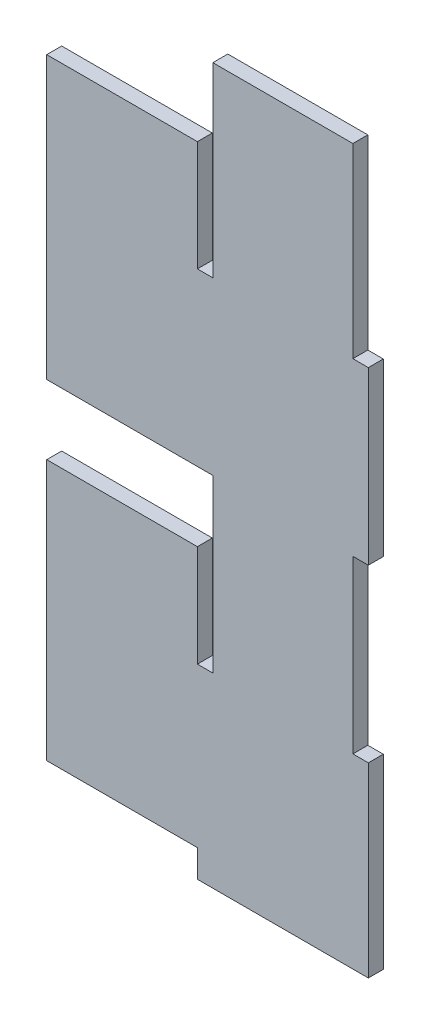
ISO-10303-21;
HEADER;
FILE_DESCRIPTION(('STEP AP214'),'2;1');
FILE_NAME('part.step','',(''),(''),'','','');
FILE_SCHEMA(('AUTOMOTIVE_DESIGN { 1 0 10303 214 1 1 1 1 }'));
ENDSEC;
DATA;
#1=APPLICATION_CONTEXT('core data for automotive mechanical design processes');
#2=APPLICATION_PROTOCOL_DEFINITION('international standard','automotive_design',2000,#1);
#3=PRODUCT_CONTEXT('',#1,'mechanical');
#4=PRODUCT('Part','Part','',(#3));
#5=PRODUCT_RELATED_PRODUCT_CATEGORY('part','',(#4));
#6=PRODUCT_DEFINITION_FORMATION('','',#4);
#7=PRODUCT_DEFINITION_CONTEXT('part definition',#1,'design');
#8=PRODUCT_DEFINITION('design','',#6,#7);
#9=PRODUCT_DEFINITION_SHAPE('','',#8);
#10=(LENGTH_UNIT() NAMED_UNIT(*) SI_UNIT(.MILLI.,.METRE.));
#11=(NAMED_UNIT(*) PLANE_ANGLE_UNIT() SI_UNIT($,.RADIAN.));
#12=(NAMED_UNIT(*) SI_UNIT($,.STERADIAN.) SOLID_ANGLE_UNIT());
#13=UNCERTAINTY_MEASURE_WITH_UNIT(LENGTH_MEASURE(1.E-05),#10,'distance_accuracy_value','');
#14=(GEOMETRIC_REPRESENTATION_CONTEXT(3) GLOBAL_UNCERTAINTY_ASSIGNED_CONTEXT((#13)) GLOBAL_UNIT_ASSIGNED_CONTEXT((#10,
#11,#12)) REPRESENTATION_CONTEXT('',''));
#15=CARTESIAN_POINT('',(0.,0.,0.));
#16=DIRECTION('',(0.,0.,1.));
#17=DIRECTION('',(1.,0.,0.));
#18=AXIS2_PLACEMENT_3D('',#15,#16,#17);
#19=CARTESIAN_POINT('',(0.,206.72,3.));
#20=DIRECTION('',(1.,0.,0.));
#21=DIRECTION('',(0.,1.,0.));
#22=AXIS2_PLACEMENT_3D('',#19,#20,#21);
#23=PLANE('',#22);
#24=DIRECTION('',(0.,-1.,0.));
#25=VECTOR('',#24,1.);
#26=CARTESIAN_POINT('',(0.,206.72,-3.));
#27=LINE('',#26,#25);
#28=CARTESIAN_POINT('',(0.,281.5,-3.));
#29=VERTEX_POINT('',#28);
#30=CARTESIAN_POINT('',(0.,206.72,-3.));
#31=VERTEX_POINT('',#30);
#32=EDGE_CURVE('E230',#29,#31,#27,.T.);
#33=ORIENTED_EDGE('',*,*,#32,.T.);
#34=DIRECTION('',(0.,0.,-1.));
#35=VECTOR('',#34,1.);
#36=CARTESIAN_POINT('',(0.,206.72,3.));
#37=LINE('',#36,#35);
#38=CARTESIAN_POINT('',(0.,206.72,3.));
#39=VERTEX_POINT('',#38);
#40=EDGE_CURVE('E11',#39,#31,#37,.T.);
#41=ORIENTED_EDGE('',*,*,#40,.F.);
#42=DIRECTION('',(0.,-1.,0.));
#43=VECTOR('',#42,1.);
#44=CARTESIAN_POINT('',(0.,206.72,3.));
#45=LINE('',#44,#43);
#46=CARTESIAN_POINT('',(0.,281.5,3.));
#47=VERTEX_POINT('',#46);
#48=EDGE_CURVE('E295',#47,#39,#45,.T.);
#49=ORIENTED_EDGE('',*,*,#48,.F.);
#50=DIRECTION('',(0.,0.,-1.));
#51=VECTOR('',#50,1.);
#52=CARTESIAN_POINT('',(0.,281.5,3.));
#53=LINE('',#52,#51);
#54=EDGE_CURVE('E226',#47,#29,#53,.T.);
#55=ORIENTED_EDGE('',*,*,#54,.T.);
#56=EDGE_LOOP('',(#33,#41,#49,#55));
#57=FACE_BOUND('',#56,.T.);
#58=ADVANCED_FACE('F45',(#57),#23,.F.);
#59=CARTESIAN_POINT('',(0.,206.72,3.));
#60=DIRECTION('',(0.,-1.,0.));
#61=DIRECTION('',(0.,0.,-1.));
#62=AXIS2_PLACEMENT_3D('',#59,#60,#61);
#63=PLANE('',#62);
#64=DIRECTION('',(-1.,0.,0.));
#65=VECTOR('',#64,1.);
#66=CARTESIAN_POINT('',(0.,206.72,-3.));
#67=LINE('',#66,#65);
#68=CARTESIAN_POINT('',(-6.20000000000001,206.72,-3.));
#69=VERTEX_POINT('',#68);
#70=EDGE_CURVE('E234',#31,#69,#67,.T.);
#71=ORIENTED_EDGE('',*,*,#70,.T.);
#72=DIRECTION('',(0.,0.,-1.));
#73=VECTOR('',#72,1.);
#74=CARTESIAN_POINT('',(-6.20000000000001,206.72,3.));
#75=LINE('',#74,#73);
#76=CARTESIAN_POINT('',(-6.20000000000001,206.72,3.));
#77=VERTEX_POINT('',#76);
#78=EDGE_CURVE('E54',#77,#69,#75,.T.);
#79=ORIENTED_EDGE('',*,*,#78,.F.);
#80=DIRECTION('',(-1.,0.,0.));
#81=VECTOR('',#80,1.);
#82=CARTESIAN_POINT('',(0.,206.72,3.));
#83=LINE('',#82,#81);
#84=EDGE_CURVE('E147',#39,#77,#83,.T.);
#85=ORIENTED_EDGE('',*,*,#84,.F.);
#86=ORIENTED_EDGE('',*,*,#40,.T.);
#87=EDGE_LOOP('',(#71,#79,#85,#86));
#88=FACE_BOUND('',#87,.T.);
#89=ADVANCED_FACE('F458',(#88),#63,.F.);
#90=CARTESIAN_POINT('',(-6.20000000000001,250.951201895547,3.));
#91=DIRECTION('',(-1.,0.,0.));
#92=DIRECTION('',(0.,0.,1.));
#93=AXIS2_PLACEMENT_3D('',#90,#91,#92);
#94=PLANE('',#93);
#95=DIRECTION('',(0.,1.,0.));
#96=VECTOR('',#95,1.);
#97=CARTESIAN_POINT('',(-6.20000000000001,250.951201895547,-3.));
#98=LINE('',#97,#96);
#99=CARTESIAN_POINT('',(-6.20000000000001,250.951201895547,-3.));
#100=VERTEX_POINT('',#99);
#101=EDGE_CURVE('E237',#69,#100,#98,.T.);
#102=ORIENTED_EDGE('',*,*,#101,.T.);
#103=DIRECTION('',(0.,0.,-1.));
#104=VECTOR('',#103,1.);
#105=CARTESIAN_POINT('',(-6.20000000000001,250.951201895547,3.));
#106=LINE('',#105,#104);
#107=CARTESIAN_POINT('',(-6.20000000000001,250.951201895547,3.));
#108=VERTEX_POINT('',#107);
#109=EDGE_CURVE('E362',#108,#100,#106,.T.);
#110=ORIENTED_EDGE('',*,*,#109,.F.);
#111=DIRECTION('',(0.,1.,0.));
#112=VECTOR('',#111,1.);
#113=CARTESIAN_POINT('',(-6.20000000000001,250.951201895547,3.));
#114=LINE('',#113,#112);
#115=EDGE_CURVE('E372',#77,#108,#114,.T.);
#116=ORIENTED_EDGE('',*,*,#115,.F.);
#117=ORIENTED_EDGE('',*,*,#78,.T.);
#118=EDGE_LOOP('',(#102,#110,#116,#117));
#119=FACE_BOUND('',#118,.T.);
#120=ADVANCED_FACE('F370',(#119),#94,.F.);
#121=CARTESIAN_POINT('',(-6.20000000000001,250.951201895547,3.));
#122=DIRECTION('',(0.,-1.,0.));
#123=DIRECTION('',(0.,0.,-1.));
#124=AXIS2_PLACEMENT_3D('',#121,#122,#123);
#125=PLANE('',#124);
#126=DIRECTION('',(-1.,0.,0.));
#127=VECTOR('',#126,1.);
#128=CARTESIAN_POINT('',(-6.20000000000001,250.951201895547,-3.));
#129=LINE('',#128,#127);
#130=CARTESIAN_POINT('',(-66.6678232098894,250.951201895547,-3.));
#131=VERTEX_POINT('',#130);
#132=EDGE_CURVE('E240',#100,#131,#129,.T.);
#133=ORIENTED_EDGE('',*,*,#132,.T.);
#134=DIRECTION('',(0.,0.,-1.));
#135=VECTOR('',#134,1.);
#136=CARTESIAN_POINT('',(-66.6678232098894,250.951201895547,3.));
#137=LINE('',#136,#135);
#138=CARTESIAN_POINT('',(-66.6678232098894,250.951201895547,3.));
#139=VERTEX_POINT('',#138);
#140=EDGE_CURVE('E358',#139,#131,#137,.T.);
#141=ORIENTED_EDGE('',*,*,#140,.F.);
#142=DIRECTION('',(-1.,0.,0.));
#143=VECTOR('',#142,1.);
#144=CARTESIAN_POINT('',(-6.20000000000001,250.951201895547,3.));
#145=LINE('',#144,#143);
#146=EDGE_CURVE('E390',#108,#139,#145,.T.);
#147=ORIENTED_EDGE('',*,*,#146,.F.);
#148=ORIENTED_EDGE('',*,*,#109,.T.);
#149=EDGE_LOOP('',(#133,#141,#147,#148));
#150=FACE_BOUND('',#149,.T.);
#151=ADVANCED_FACE('F380',(#150),#125,.F.);
#152=CARTESIAN_POINT('',(-66.6678232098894,250.951201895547,3.));
#153=DIRECTION('',(1.,0.,0.));
#154=DIRECTION('',(0.,0.,-1.));
#155=AXIS2_PLACEMENT_3D('',#152,#153,#154);
#156=PLANE('',#155);
#157=DIRECTION('',(0.,-1.,0.));
#158=VECTOR('',#157,1.);
#159=CARTESIAN_POINT('',(-66.6678232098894,250.951201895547,-3.));
#160=LINE('',#159,#158);
#161=CARTESIAN_POINT('',(-66.6678232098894,138.04,-3.));
#162=VERTEX_POINT('',#161);
#163=EDGE_CURVE('E243',#131,#162,#160,.T.);
#164=ORIENTED_EDGE('',*,*,#163,.T.);
#165=DIRECTION('',(0.,0.,-1.));
#166=VECTOR('',#165,1.);
#167=CARTESIAN_POINT('',(-66.6678232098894,138.04,3.));
#168=LINE('',#167,#166);
#169=CARTESIAN_POINT('',(-66.6678232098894,138.04,3.));
#170=VERTEX_POINT('',#169);
#171=EDGE_CURVE('E354',#170,#162,#168,.T.);
#172=ORIENTED_EDGE('',*,*,#171,.F.);
#173=DIRECTION('',(0.,-1.,0.));
#174=VECTOR('',#173,1.);
#175=CARTESIAN_POINT('',(-66.6678232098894,250.951201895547,3.));
#176=LINE('',#175,#174);
#177=EDGE_CURVE('E386',#139,#170,#176,.T.);
#178=ORIENTED_EDGE('',*,*,#177,.F.);
#179=ORIENTED_EDGE('',*,*,#140,.T.);
#180=EDGE_LOOP('',(#164,#172,#178,#179));
#181=FACE_BOUND('',#180,.T.);
#182=ADVANCED_FACE('F384',(#181),#156,.F.);
#183=CARTESIAN_POINT('',(0.,138.04,3.));
#184=DIRECTION('',(0.,1.,0.));
#185=DIRECTION('',(0.,0.,1.));
#186=AXIS2_PLACEMENT_3D('',#183,#184,#185);
#187=PLANE('',#186);
#188=DIRECTION('',(1.,0.,0.));
#189=VECTOR('',#188,1.);
#190=CARTESIAN_POINT('',(0.,138.04,-3.));
#191=LINE('',#190,#189);
#192=CARTESIAN_POINT('',(0.,138.04,-3.));
#193=VERTEX_POINT('',#192);
#194=EDGE_CURVE('E247',#162,#193,#191,.T.);
#195=ORIENTED_EDGE('',*,*,#194,.T.);
#196=DIRECTION('',(0.,0.,-1.));
#197=VECTOR('',#196,1.);
#198=CARTESIAN_POINT('',(0.,138.04,3.));
#199=LINE('',#198,#197);
#200=CARTESIAN_POINT('',(0.,138.04,3.));
#201=VERTEX_POINT('',#200);
#202=EDGE_CURVE('E350',#201,#193,#199,.T.);
#203=ORIENTED_EDGE('',*,*,#202,.F.);
#204=DIRECTION('',(1.,0.,0.));
#205=VECTOR('',#204,1.);
#206=CARTESIAN_POINT('',(-6.19999999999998,138.04,3.));
#207=LINE('',#206,#205);
#208=EDGE_CURVE('E389',#170,#201,#207,.T.);
#209=ORIENTED_EDGE('',*,*,#208,.F.);
#210=ORIENTED_EDGE('',*,*,#171,.T.);
#211=EDGE_LOOP('',(#195,#203,#209,#210));
#212=FACE_BOUND('',#211,.T.);
#213=ADVANCED_FACE('F471',(#212),#187,.F.);
#214=CARTESIAN_POINT('',(0.,69.3600000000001,3.));
#215=DIRECTION('',(1.,0.,0.));
#216=DIRECTION('',(0.,1.,0.));
#217=AXIS2_PLACEMENT_3D('',#214,#215,#216);
#218=PLANE('',#217);
#219=DIRECTION('',(0.,-1.,0.));
#220=VECTOR('',#219,1.);
#221=CARTESIAN_POINT('',(0.,69.3600000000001,-3.));
#222=LINE('',#221,#220);
#223=CARTESIAN_POINT('',(0.,69.3600000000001,-3.));
#224=VERTEX_POINT('',#223);
#225=EDGE_CURVE('E250',#193,#224,#222,.T.);
#226=ORIENTED_EDGE('',*,*,#225,.T.);
#227=DIRECTION('',(0.,0.,-1.));
#228=VECTOR('',#227,1.);
#229=CARTESIAN_POINT('',(0.,69.3600000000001,3.));
#230=LINE('',#229,#228);
#231=CARTESIAN_POINT('',(0.,69.3600000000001,3.));
#232=VERTEX_POINT('',#231);
#233=EDGE_CURVE('E346',#232,#224,#230,.T.);
#234=ORIENTED_EDGE('',*,*,#233,.F.);
#235=DIRECTION('',(0.,-1.,0.));
#236=VECTOR('',#235,1.);
#237=CARTESIAN_POINT('',(0.,69.3600000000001,3.));
#238=LINE('',#237,#236);
#239=EDGE_CURVE('E394',#201,#232,#238,.T.);
#240=ORIENTED_EDGE('',*,*,#239,.F.);
#241=ORIENTED_EDGE('',*,*,#202,.T.);
#242=EDGE_LOOP('',(#226,#234,#240,#241));
#243=FACE_BOUND('',#242,.T.);
#244=ADVANCED_FACE('F474',(#243),#218,.F.);
#245=CARTESIAN_POINT('',(0.,69.3600000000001,3.));
#246=DIRECTION('',(0.,-1.,0.));
#247=DIRECTION('',(0.,0.,-1.));
#248=AXIS2_PLACEMENT_3D('',#245,#246,#247);
#249=PLANE('',#248);
#250=DIRECTION('',(-1.,0.,0.));
#251=VECTOR('',#250,1.);
#252=CARTESIAN_POINT('',(0.,69.3600000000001,-3.));
#253=LINE('',#252,#251);
#254=CARTESIAN_POINT('',(-6.19999999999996,69.3600000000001,-3.));
#255=VERTEX_POINT('',#254);
#256=EDGE_CURVE('E253',#224,#255,#253,.T.);
#257=ORIENTED_EDGE('',*,*,#256,.T.);
#258=DIRECTION('',(0.,0.,-1.));
#259=VECTOR('',#258,1.);
#260=CARTESIAN_POINT('',(-6.19999999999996,69.3600000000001,3.));
#261=LINE('',#260,#259);
#262=CARTESIAN_POINT('',(-6.19999999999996,69.3600000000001,3.));
#263=VERTEX_POINT('',#262);
#264=EDGE_CURVE('E342',#263,#255,#261,.T.);
#265=ORIENTED_EDGE('',*,*,#264,.F.);
#266=DIRECTION('',(-1.,0.,0.));
#267=VECTOR('',#266,1.);
#268=CARTESIAN_POINT('',(0.,69.3600000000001,3.));
#269=LINE('',#268,#267);
#270=EDGE_CURVE('E401',#232,#263,#269,.T.);
#271=ORIENTED_EDGE('',*,*,#270,.F.);
#272=ORIENTED_EDGE('',*,*,#233,.T.);
#273=EDGE_LOOP('',(#257,#265,#271,#272));
#274=FACE_BOUND('',#273,.T.);
#275=ADVANCED_FACE('F478',(#274),#249,.F.);
#276=CARTESIAN_POINT('',(-6.19999999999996,69.3600000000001,3.));
#277=DIRECTION('',(-1.,0.,0.));
#278=DIRECTION('',(0.,-1.,0.));
#279=AXIS2_PLACEMENT_3D('',#276,#277,#278);
#280=PLANE('',#279);
#281=DIRECTION('',(0.,1.,0.));
#282=VECTOR('',#281,1.);
#283=CARTESIAN_POINT('',(-6.19999999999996,69.3600000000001,-3.));
#284=LINE('',#283,#282);
#285=CARTESIAN_POINT('',(-6.19999999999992,110.191945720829,-3.));
#286=VERTEX_POINT('',#285);
#287=EDGE_CURVE('E256',#255,#286,#284,.T.);
#288=ORIENTED_EDGE('',*,*,#287,.T.);
#289=DIRECTION('',(0.,0.,-1.));
#290=VECTOR('',#289,1.);
#291=CARTESIAN_POINT('',(-6.19999999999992,110.191945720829,3.));
#292=LINE('',#291,#290);
#293=CARTESIAN_POINT('',(-6.19999999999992,110.191945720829,3.));
#294=VERTEX_POINT('',#293);
#295=EDGE_CURVE('E338',#294,#286,#292,.T.);
#296=ORIENTED_EDGE('',*,*,#295,.F.);
#297=DIRECTION('',(0.,1.,0.));
#298=VECTOR('',#297,1.);
#299=CARTESIAN_POINT('',(-6.19999999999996,69.3600000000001,3.));
#300=LINE('',#299,#298);
#301=EDGE_CURVE('E404',#263,#294,#300,.T.);
#302=ORIENTED_EDGE('',*,*,#301,.F.);
#303=ORIENTED_EDGE('',*,*,#264,.T.);
#304=EDGE_LOOP('',(#288,#296,#302,#303));
#305=FACE_BOUND('',#304,.T.);
#306=ADVANCED_FACE('F482',(#305),#280,.F.);
#307=CARTESIAN_POINT('',(-6.19999999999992,110.191945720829,3.));
#308=DIRECTION('',(0.,-1.,0.));
#309=DIRECTION('',(0.,0.,-1.));
#310=AXIS2_PLACEMENT_3D('',#307,#308,#309);
#311=PLANE('',#310);
#312=DIRECTION('',(-1.,0.,0.));
#313=VECTOR('',#312,1.);
#314=CARTESIAN_POINT('',(-6.19999999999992,110.191945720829,-3.));
#315=LINE('',#314,#313);
#316=CARTESIAN_POINT('',(-66.6678232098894,110.191945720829,-3.));
#317=VERTEX_POINT('',#316);
#318=EDGE_CURVE('E259',#286,#317,#315,.T.);
#319=ORIENTED_EDGE('',*,*,#318,.T.);
#320=DIRECTION('',(0.,0.,-1.));
#321=VECTOR('',#320,1.);
#322=CARTESIAN_POINT('',(-66.6678232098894,110.191945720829,3.));
#323=LINE('',#322,#321);
#324=CARTESIAN_POINT('',(-66.6678232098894,110.191945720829,3.));
#325=VERTEX_POINT('',#324);
#326=EDGE_CURVE('E334',#325,#317,#323,.T.);
#327=ORIENTED_EDGE('',*,*,#326,.F.);
#328=DIRECTION('',(-1.,0.,0.));
#329=VECTOR('',#328,1.);
#330=CARTESIAN_POINT('',(-6.19999999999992,110.191945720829,3.));
#331=LINE('',#330,#329);
#332=EDGE_CURVE('E407',#294,#325,#331,.T.);
#333=ORIENTED_EDGE('',*,*,#332,.F.);
#334=ORIENTED_EDGE('',*,*,#295,.T.);
#335=EDGE_LOOP('',(#319,#327,#333,#334));
#336=FACE_BOUND('',#335,.T.);
#337=ADVANCED_FACE('F486',(#336),#311,.F.);
#338=CARTESIAN_POINT('',(-66.6678232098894,5.58000000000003,3.));
#339=DIRECTION('',(1.,0.,0.));
#340=DIRECTION('',(0.,0.,-1.));
#341=AXIS2_PLACEMENT_3D('',#338,#339,#340);
#342=PLANE('',#341);
#343=DIRECTION('',(0.,-1.,0.));
#344=VECTOR('',#343,1.);
#345=CARTESIAN_POINT('',(-66.6678232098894,5.58000000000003,-3.));
#346=LINE('',#345,#344);
#347=CARTESIAN_POINT('',(-66.6678232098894,5.58000000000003,-3.));
#348=VERTEX_POINT('',#347);
#349=EDGE_CURVE('E262',#317,#348,#346,.T.);
#350=ORIENTED_EDGE('',*,*,#349,.T.);
#351=DIRECTION('',(0.,0.,-1.));
#352=VECTOR('',#351,1.);
#353=CARTESIAN_POINT('',(-66.6678232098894,5.58000000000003,3.));
#354=LINE('',#353,#352);
#355=CARTESIAN_POINT('',(-66.6678232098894,5.58000000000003,3.));
#356=VERTEX_POINT('',#355);
#357=EDGE_CURVE('E330',#356,#348,#354,.T.);
#358=ORIENTED_EDGE('',*,*,#357,.F.);
#359=DIRECTION('',(0.,-1.,0.));
#360=VECTOR('',#359,1.);
#361=CARTESIAN_POINT('',(-66.6678232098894,5.58000000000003,3.));
#362=LINE('',#361,#360);
#363=EDGE_CURVE('E410',#325,#356,#362,.T.);
#364=ORIENTED_EDGE('',*,*,#363,.F.);
#365=ORIENTED_EDGE('',*,*,#326,.T.);
#366=EDGE_LOOP('',(#350,#358,#364,#365));
#367=FACE_BOUND('',#366,.T.);
#368=ADVANCED_FACE('F490',(#367),#342,.F.);
#369=CARTESIAN_POINT('',(-6.19999999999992,5.58000000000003,3.));
#370=DIRECTION('',(0.,1.,0.));
#371=DIRECTION('',(0.,0.,1.));
#372=AXIS2_PLACEMENT_3D('',#369,#370,#371);
#373=PLANE('',#372);
#374=DIRECTION('',(1.,0.,0.));
#375=VECTOR('',#374,1.);
#376=CARTESIAN_POINT('',(-6.19999999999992,5.58000000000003,-3.));
#377=LINE('',#376,#375);
#378=CARTESIAN_POINT('',(-6.19999999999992,5.58000000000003,-3.));
#379=VERTEX_POINT('',#378);
#380=EDGE_CURVE('E265',#348,#379,#377,.T.);
#381=ORIENTED_EDGE('',*,*,#380,.T.);
#382=DIRECTION('',(0.,0.,-1.));
#383=VECTOR('',#382,1.);
#384=CARTESIAN_POINT('',(-6.19999999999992,5.58000000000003,3.));
#385=LINE('',#384,#383);
#386=CARTESIAN_POINT('',(-6.19999999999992,5.58000000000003,3.));
#387=VERTEX_POINT('',#386);
#388=EDGE_CURVE('E326',#387,#379,#385,.T.);
#389=ORIENTED_EDGE('',*,*,#388,.F.);
#390=DIRECTION('',(1.,0.,0.));
#391=VECTOR('',#390,1.);
#392=CARTESIAN_POINT('',(-6.19999999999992,5.58000000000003,3.));
#393=LINE('',#392,#391);
#394=EDGE_CURVE('E413',#356,#387,#393,.T.);
#395=ORIENTED_EDGE('',*,*,#394,.F.);
#396=ORIENTED_EDGE('',*,*,#357,.T.);
#397=EDGE_LOOP('',(#381,#389,#395,#396));
#398=FACE_BOUND('',#397,.T.);
#399=ADVANCED_FACE('F494',(#398),#373,.F.);
#400=CARTESIAN_POINT('',(-6.19999999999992,5.58000000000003,3.));
#401=DIRECTION('',(1.,0.,0.));
#402=DIRECTION('',(0.,1.,0.));
#403=AXIS2_PLACEMENT_3D('',#400,#401,#402);
#404=PLANE('',#403);
#405=DIRECTION('',(0.,-1.,0.));
#406=VECTOR('',#405,1.);
#407=CARTESIAN_POINT('',(-6.19999999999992,5.58000000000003,-3.));
#408=LINE('',#407,#406);
#409=CARTESIAN_POINT('',(-6.19999999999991,-5.41999999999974,-3.));
#410=VERTEX_POINT('',#409);
#411=EDGE_CURVE('E268',#379,#410,#408,.T.);
#412=ORIENTED_EDGE('',*,*,#411,.T.);
#413=DIRECTION('',(0.,0.,-1.));
#414=VECTOR('',#413,1.);
#415=CARTESIAN_POINT('',(-6.19999999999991,-5.41999999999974,3.));
#416=LINE('',#415,#414);
#417=CARTESIAN_POINT('',(-6.19999999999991,-5.41999999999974,3.));
#418=VERTEX_POINT('',#417);
#419=EDGE_CURVE('E322',#418,#410,#416,.T.);
#420=ORIENTED_EDGE('',*,*,#419,.F.);
#421=DIRECTION('',(0.,-1.,0.));
#422=VECTOR('',#421,1.);
#423=CARTESIAN_POINT('',(-6.19999999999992,5.58000000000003,3.));
#424=LINE('',#423,#422);
#425=EDGE_CURVE('E416',#387,#418,#424,.T.);
#426=ORIENTED_EDGE('',*,*,#425,.F.);
#427=ORIENTED_EDGE('',*,*,#388,.T.);
#428=EDGE_LOOP('',(#412,#420,#426,#427));
#429=FACE_BOUND('',#428,.T.);
#430=ADVANCED_FACE('F498',(#429),#404,.F.);
#431=CARTESIAN_POINT('',(-6.19999999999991,-5.41999999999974,3.));
#432=DIRECTION('',(0.,1.,0.));
#433=DIRECTION('',(-1.,0.,0.));
#434=AXIS2_PLACEMENT_3D('',#431,#432,#433);
#435=PLANE('',#434);
#436=DIRECTION('',(1.,0.,0.));
#437=VECTOR('',#436,1.);
#438=CARTESIAN_POINT('',(-6.19999999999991,-5.41999999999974,-3.));
#439=LINE('',#438,#437);
#440=CARTESIAN_POINT('',(62.4,-5.41999999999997,-3.));
#441=VERTEX_POINT('',#440);
#442=EDGE_CURVE('E271',#410,#441,#439,.T.);
#443=ORIENTED_EDGE('',*,*,#442,.T.);
#444=DIRECTION('',(0.,0.,-1.));
#445=VECTOR('',#444,1.);
#446=CARTESIAN_POINT('',(62.4,-5.41999999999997,3.));
#447=LINE('',#446,#445);
#448=CARTESIAN_POINT('',(62.4,-5.41999999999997,3.));
#449=VERTEX_POINT('',#448);
#450=EDGE_CURVE('E318',#449,#441,#447,.T.);
#451=ORIENTED_EDGE('',*,*,#450,.F.);
#452=DIRECTION('',(1.,0.,0.));
#453=VECTOR('',#452,1.);
#454=CARTESIAN_POINT('',(-6.19999999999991,-5.41999999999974,3.));
#455=LINE('',#454,#453);
#456=EDGE_CURVE('E419',#418,#449,#455,.T.);
#457=ORIENTED_EDGE('',*,*,#456,.F.);
#458=ORIENTED_EDGE('',*,*,#419,.T.);
#459=EDGE_LOOP('',(#443,#451,#457,#458));
#460=FACE_BOUND('',#459,.T.);
#461=ADVANCED_FACE('F502',(#460),#435,.F.);
#462=CARTESIAN_POINT('',(62.4,-5.41999999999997,3.));
#463=DIRECTION('',(-1.,0.,0.));
#464=DIRECTION('',(0.,-1.,0.));
#465=AXIS2_PLACEMENT_3D('',#462,#463,#464);
#466=PLANE('',#465);
#467=DIRECTION('',(0.,1.,0.));
#468=VECTOR('',#467,1.);
#469=CARTESIAN_POINT('',(62.4,-5.41999999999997,-3.));
#470=LINE('',#469,#468);
#471=CARTESIAN_POINT('',(62.4,69.36,-3.));
#472=VERTEX_POINT('',#471);
#473=EDGE_CURVE('E274',#441,#472,#470,.T.);
#474=ORIENTED_EDGE('',*,*,#473,.T.);
#475=DIRECTION('',(0.,0.,-1.));
#476=VECTOR('',#475,1.);
#477=CARTESIAN_POINT('',(62.4,69.36,3.));
#478=LINE('',#477,#476);
#479=CARTESIAN_POINT('',(62.4,69.36,3.));
#480=VERTEX_POINT('',#479);
#481=EDGE_CURVE('E314',#480,#472,#478,.T.);
#482=ORIENTED_EDGE('',*,*,#481,.F.);
#483=DIRECTION('',(0.,1.,0.));
#484=VECTOR('',#483,1.);
#485=CARTESIAN_POINT('',(62.4,-5.41999999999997,3.));
#486=LINE('',#485,#484);
#487=EDGE_CURVE('E422',#449,#480,#486,.T.);
#488=ORIENTED_EDGE('',*,*,#487,.F.);
#489=ORIENTED_EDGE('',*,*,#450,.T.);
#490=EDGE_LOOP('',(#474,#482,#488,#489));
#491=FACE_BOUND('',#490,.T.);
#492=ADVANCED_FACE('F506',(#491),#466,.F.);
#493=CARTESIAN_POINT('',(56.2,69.36,3.));
#494=DIRECTION('',(0.,-1.,0.));
#495=DIRECTION('',(0.,0.,-1.));
#496=AXIS2_PLACEMENT_3D('',#493,#494,#495);
#497=PLANE('',#496);
#498=DIRECTION('',(-1.,0.,0.));
#499=VECTOR('',#498,1.);
#500=CARTESIAN_POINT('',(56.2,69.36,-3.));
#501=LINE('',#500,#499);
#502=CARTESIAN_POINT('',(56.2,69.36,-3.));
#503=VERTEX_POINT('',#502);
#504=EDGE_CURVE('E277',#472,#503,#501,.T.);
#505=ORIENTED_EDGE('',*,*,#504,.T.);
#506=DIRECTION('',(0.,0.,-1.));
#507=VECTOR('',#506,1.);
#508=CARTESIAN_POINT('',(56.2,69.36,3.));
#509=LINE('',#508,#507);
#510=CARTESIAN_POINT('',(56.2,69.36,3.));
#511=VERTEX_POINT('',#510);
#512=EDGE_CURVE('E310',#511,#503,#509,.T.);
#513=ORIENTED_EDGE('',*,*,#512,.F.);
#514=DIRECTION('',(-1.,0.,0.));
#515=VECTOR('',#514,1.);
#516=CARTESIAN_POINT('',(56.2,69.36,3.));
#517=LINE('',#516,#515);
#518=EDGE_CURVE('E425',#480,#511,#517,.T.);
#519=ORIENTED_EDGE('',*,*,#518,.F.);
#520=ORIENTED_EDGE('',*,*,#481,.T.);
#521=EDGE_LOOP('',(#505,#513,#519,#520));
#522=FACE_BOUND('',#521,.T.);
#523=ADVANCED_FACE('F510',(#522),#497,.F.);
#524=CARTESIAN_POINT('',(56.2,138.04,3.));
#525=DIRECTION('',(-1.,0.,0.));
#526=DIRECTION('',(0.,-1.,0.));
#527=AXIS2_PLACEMENT_3D('',#524,#525,#526);
#528=PLANE('',#527);
#529=DIRECTION('',(0.,1.,0.));
#530=VECTOR('',#529,1.);
#531=CARTESIAN_POINT('',(56.2,138.04,-3.));
#532=LINE('',#531,#530);
#533=CARTESIAN_POINT('',(56.2,138.04,-3.));
#534=VERTEX_POINT('',#533);
#535=EDGE_CURVE('E280',#503,#534,#532,.T.);
#536=ORIENTED_EDGE('',*,*,#535,.T.);
#537=DIRECTION('',(0.,0.,-1.));
#538=VECTOR('',#537,1.);
#539=CARTESIAN_POINT('',(56.2,138.04,3.));
#540=LINE('',#539,#538);
#541=CARTESIAN_POINT('',(56.2,138.04,3.));
#542=VERTEX_POINT('',#541);
#543=EDGE_CURVE('E306',#542,#534,#540,.T.);
#544=ORIENTED_EDGE('',*,*,#543,.F.);
#545=DIRECTION('',(0.,1.,0.));
#546=VECTOR('',#545,1.);
#547=CARTESIAN_POINT('',(56.2,138.04,3.));
#548=LINE('',#547,#546);
#549=EDGE_CURVE('E428',#511,#542,#548,.T.);
#550=ORIENTED_EDGE('',*,*,#549,.F.);
#551=ORIENTED_EDGE('',*,*,#512,.T.);
#552=EDGE_LOOP('',(#536,#544,#550,#551));
#553=FACE_BOUND('',#552,.T.);
#554=ADVANCED_FACE('F514',(#553),#528,.F.);
#555=CARTESIAN_POINT('',(56.2,138.04,3.));
#556=DIRECTION('',(0.,1.,0.));
#557=DIRECTION('',(0.,0.,1.));
#558=AXIS2_PLACEMENT_3D('',#555,#556,#557);
#559=PLANE('',#558);
#560=DIRECTION('',(1.,0.,0.));
#561=VECTOR('',#560,1.);
#562=CARTESIAN_POINT('',(56.2,138.04,-3.));
#563=LINE('',#562,#561);
#564=CARTESIAN_POINT('',(62.4,138.04,-3.));
#565=VERTEX_POINT('',#564);
#566=EDGE_CURVE('E283',#534,#565,#563,.T.);
#567=ORIENTED_EDGE('',*,*,#566,.T.);
#568=DIRECTION('',(0.,0.,-1.));
#569=VECTOR('',#568,1.);
#570=CARTESIAN_POINT('',(62.4,138.04,3.));
#571=LINE('',#570,#569);
#572=CARTESIAN_POINT('',(62.4,138.04,3.));
#573=VERTEX_POINT('',#572);
#574=EDGE_CURVE('E302',#573,#565,#571,.T.);
#575=ORIENTED_EDGE('',*,*,#574,.F.);
#576=DIRECTION('',(1.,0.,0.));
#577=VECTOR('',#576,1.);
#578=CARTESIAN_POINT('',(56.2,138.04,3.));
#579=LINE('',#578,#577);
#580=EDGE_CURVE('E431',#542,#573,#579,.T.);
#581=ORIENTED_EDGE('',*,*,#580,.F.);
#582=ORIENTED_EDGE('',*,*,#543,.T.);
#583=EDGE_LOOP('',(#567,#575,#581,#582));
#584=FACE_BOUND('',#583,.T.);
#585=ADVANCED_FACE('F439',(#584),#559,.F.);
#586=CARTESIAN_POINT('',(62.4,206.72,3.));
#587=DIRECTION('',(-1.,0.,0.));
#588=DIRECTION('',(0.,-1.,0.));
#589=AXIS2_PLACEMENT_3D('',#586,#587,#588);
#590=PLANE('',#589);
#591=DIRECTION('',(0.,1.,0.));
#592=VECTOR('',#591,1.);
#593=CARTESIAN_POINT('',(62.4,206.72,-3.));
#594=LINE('',#593,#592);
#595=CARTESIAN_POINT('',(62.4,206.72,-3.));
#596=VERTEX_POINT('',#595);
#597=EDGE_CURVE('E286',#565,#596,#594,.T.);
#598=ORIENTED_EDGE('',*,*,#597,.T.);
#599=DIRECTION('',(0.,0.,-1.));
#600=VECTOR('',#599,1.);
#601=CARTESIAN_POINT('',(62.4,206.72,3.));
#602=LINE('',#601,#600);
#603=CARTESIAN_POINT('',(62.4,206.72,3.));
#604=VERTEX_POINT('',#603);
#605=EDGE_CURVE('E219',#604,#596,#602,.T.);
#606=ORIENTED_EDGE('',*,*,#605,.F.);
#607=DIRECTION('',(0.,1.,0.));
#608=VECTOR('',#607,1.);
#609=CARTESIAN_POINT('',(62.4,206.72,3.));
#610=LINE('',#609,#608);
#611=EDGE_CURVE('E208',#573,#604,#610,.T.);
#612=ORIENTED_EDGE('',*,*,#611,.F.);
#613=ORIENTED_EDGE('',*,*,#574,.T.);
#614=EDGE_LOOP('',(#598,#606,#612,#613));
#615=FACE_BOUND('',#614,.T.);
#616=ADVANCED_FACE('F443',(#615),#590,.F.);
#617=CARTESIAN_POINT('',(56.2,206.72,3.));
#618=DIRECTION('',(0.,-1.,0.));
#619=DIRECTION('',(0.,0.,-1.));
#620=AXIS2_PLACEMENT_3D('',#617,#618,#619);
#621=PLANE('',#620);
#622=DIRECTION('',(-1.,0.,0.));
#623=VECTOR('',#622,1.);
#624=CARTESIAN_POINT('',(56.2,206.72,-3.));
#625=LINE('',#624,#623);
#626=CARTESIAN_POINT('',(56.2,206.72,-3.));
#627=VERTEX_POINT('',#626);
#628=EDGE_CURVE('E217',#596,#627,#625,.T.);
#629=ORIENTED_EDGE('',*,*,#628,.T.);
#630=DIRECTION('',(0.,0.,-1.));
#631=VECTOR('',#630,1.);
#632=CARTESIAN_POINT('',(56.2,206.72,3.));
#633=LINE('',#632,#631);
#634=CARTESIAN_POINT('',(56.2,206.72,3.));
#635=VERTEX_POINT('',#634);
#636=EDGE_CURVE('E214',#635,#627,#633,.T.);
#637=ORIENTED_EDGE('',*,*,#636,.F.);
#638=DIRECTION('',(-1.,0.,0.));
#639=VECTOR('',#638,1.);
#640=CARTESIAN_POINT('',(56.2,206.72,3.));
#641=LINE('',#640,#639);
#642=EDGE_CURVE('E202',#604,#635,#641,.T.);
#643=ORIENTED_EDGE('',*,*,#642,.F.);
#644=ORIENTED_EDGE('',*,*,#605,.T.);
#645=EDGE_LOOP('',(#629,#637,#643,#644));
#646=FACE_BOUND('',#645,.T.);
#647=ADVANCED_FACE('F215',(#646),#621,.F.);
#648=CARTESIAN_POINT('',(56.2,206.72,3.));
#649=DIRECTION('',(-1.,0.,0.));
#650=DIRECTION('',(0.,-1.,0.));
#651=AXIS2_PLACEMENT_3D('',#648,#649,#650);
#652=PLANE('',#651);
#653=DIRECTION('',(0.,1.,0.));
#654=VECTOR('',#653,1.);
#655=CARTESIAN_POINT('',(56.2,206.72,-3.));
#656=LINE('',#655,#654);
#657=CARTESIAN_POINT('',(56.2,281.5,-3.));
#658=VERTEX_POINT('',#657);
#659=EDGE_CURVE('E133',#627,#658,#656,.T.);
#660=ORIENTED_EDGE('',*,*,#659,.T.);
#661=DIRECTION('',(0.,0.,-1.));
#662=VECTOR('',#661,1.);
#663=CARTESIAN_POINT('',(56.2,281.5,3.));
#664=LINE('',#663,#662);
#665=CARTESIAN_POINT('',(56.2,281.5,3.));
#666=VERTEX_POINT('',#665);
#667=EDGE_CURVE('E220',#666,#658,#664,.T.);
#668=ORIENTED_EDGE('',*,*,#667,.F.);
#669=DIRECTION('',(0.,1.,0.));
#670=VECTOR('',#669,1.);
#671=CARTESIAN_POINT('',(56.2,206.72,3.));
#672=LINE('',#671,#670);
#673=EDGE_CURVE('E206',#635,#666,#672,.T.);
#674=ORIENTED_EDGE('',*,*,#673,.F.);
#675=ORIENTED_EDGE('',*,*,#636,.T.);
#676=EDGE_LOOP('',(#660,#668,#674,#675));
#677=FACE_BOUND('',#676,.T.);
#678=ADVANCED_FACE('F222',(#677),#652,.F.);
#679=CARTESIAN_POINT('',(56.2,281.5,3.));
#680=DIRECTION('',(0.,-1.,0.));
#681=DIRECTION('',(0.,0.,-1.));
#682=AXIS2_PLACEMENT_3D('',#679,#680,#681);
#683=PLANE('',#682);
#684=DIRECTION('',(-1.,0.,0.));
#685=VECTOR('',#684,1.);
#686=CARTESIAN_POINT('',(56.2,281.5,-3.));
#687=LINE('',#686,#685);
#688=EDGE_CURVE('E139',#658,#29,#687,.T.);
#689=ORIENTED_EDGE('',*,*,#688,.T.);
#690=ORIENTED_EDGE('',*,*,#54,.F.);
#691=DIRECTION('',(-1.,0.,0.));
#692=VECTOR('',#691,1.);
#693=CARTESIAN_POINT('',(56.2,281.5,3.));
#694=LINE('',#693,#692);
#695=EDGE_CURVE('E62',#666,#47,#694,.T.);
#696=ORIENTED_EDGE('',*,*,#695,.F.);
#697=ORIENTED_EDGE('',*,*,#667,.T.);
#698=EDGE_LOOP('',(#689,#690,#696,#697));
#699=FACE_BOUND('',#698,.T.);
#700=ADVANCED_FACE('F447',(#699),#683,.F.);
#701=CARTESIAN_POINT('',(0.,0.,3.));
#702=DIRECTION('',(0.,0.,1.));
#703=DIRECTION('',(1.,0.,0.));
#704=AXIS2_PLACEMENT_3D('',#701,#702,#703);
#705=PLANE('',#704);
#706=ORIENTED_EDGE('',*,*,#48,.T.);
#707=ORIENTED_EDGE('',*,*,#84,.T.);
#708=ORIENTED_EDGE('',*,*,#115,.T.);
#709=ORIENTED_EDGE('',*,*,#146,.T.);
#710=ORIENTED_EDGE('',*,*,#177,.T.);
#711=ORIENTED_EDGE('',*,*,#208,.T.);
#712=ORIENTED_EDGE('',*,*,#239,.T.);
#713=ORIENTED_EDGE('',*,*,#270,.T.);
#714=ORIENTED_EDGE('',*,*,#301,.T.);
#715=ORIENTED_EDGE('',*,*,#332,.T.);
#716=ORIENTED_EDGE('',*,*,#363,.T.);
#717=ORIENTED_EDGE('',*,*,#394,.T.);
#718=ORIENTED_EDGE('',*,*,#425,.T.);
#719=ORIENTED_EDGE('',*,*,#456,.T.);
#720=ORIENTED_EDGE('',*,*,#487,.T.);
#721=ORIENTED_EDGE('',*,*,#518,.T.);
#722=ORIENTED_EDGE('',*,*,#549,.T.);
#723=ORIENTED_EDGE('',*,*,#580,.T.);
#724=ORIENTED_EDGE('',*,*,#611,.T.);
#725=ORIENTED_EDGE('',*,*,#642,.T.);
#726=ORIENTED_EDGE('',*,*,#673,.T.);
#727=ORIENTED_EDGE('',*,*,#695,.T.);
#728=EDGE_LOOP('',(#706,#707,#708,#709,#710,#711,#712,#713,#714,#715,#716,#717,#718,#719,#720,
#721,#722,#723,#724,#725,#726,#727));
#729=FACE_BOUND('',#728,.T.);
#730=ADVANCED_FACE('F204',(#729),#705,.T.);
#731=CARTESIAN_POINT('',(0.,0.,-3.));
#732=DIRECTION('',(0.,0.,1.));
#733=DIRECTION('',(1.,0.,0.));
#734=AXIS2_PLACEMENT_3D('',#731,#732,#733);
#735=PLANE('',#734);
#736=ORIENTED_EDGE('',*,*,#32,.F.);
#737=ORIENTED_EDGE('',*,*,#688,.F.);
#738=ORIENTED_EDGE('',*,*,#659,.F.);
#739=ORIENTED_EDGE('',*,*,#628,.F.);
#740=ORIENTED_EDGE('',*,*,#597,.F.);
#741=ORIENTED_EDGE('',*,*,#566,.F.);
#742=ORIENTED_EDGE('',*,*,#535,.F.);
#743=ORIENTED_EDGE('',*,*,#504,.F.);
#744=ORIENTED_EDGE('',*,*,#473,.F.);
#745=ORIENTED_EDGE('',*,*,#442,.F.);
#746=ORIENTED_EDGE('',*,*,#411,.F.);
#747=ORIENTED_EDGE('',*,*,#380,.F.);
#748=ORIENTED_EDGE('',*,*,#349,.F.);
#749=ORIENTED_EDGE('',*,*,#318,.F.);
#750=ORIENTED_EDGE('',*,*,#287,.F.);
#751=ORIENTED_EDGE('',*,*,#256,.F.);
#752=ORIENTED_EDGE('',*,*,#225,.F.);
#753=ORIENTED_EDGE('',*,*,#194,.F.);
#754=ORIENTED_EDGE('',*,*,#163,.F.);
#755=ORIENTED_EDGE('',*,*,#132,.F.);
#756=ORIENTED_EDGE('',*,*,#101,.F.);
#757=ORIENTED_EDGE('',*,*,#70,.F.);
#758=EDGE_LOOP('',(#736,#737,#738,#739,#740,#741,#742,#743,#744,#745,#746,#747,#748,#749,#750,
#751,#752,#753,#754,#755,#756,#757));
#759=FACE_BOUND('',#758,.T.);
#760=ADVANCED_FACE('F376',(#759),#735,.F.);
#761=CLOSED_SHELL('',(#58,#89,#120,#151,#182,#213,#244,#275,#306,#337,#368,#399,#430,#461,#492,
#523,#554,#585,#616,#647,#678,#700,#730,#760));
#762=MANIFOLD_SOLID_BREP('B2',#761);
#763=ADVANCED_BREP_SHAPE_REPRESENTATION('',(#18,#762),#14);
#764=SHAPE_DEFINITION_REPRESENTATION(#9,#763);
ENDSEC;
END-ISO-10303-21;
